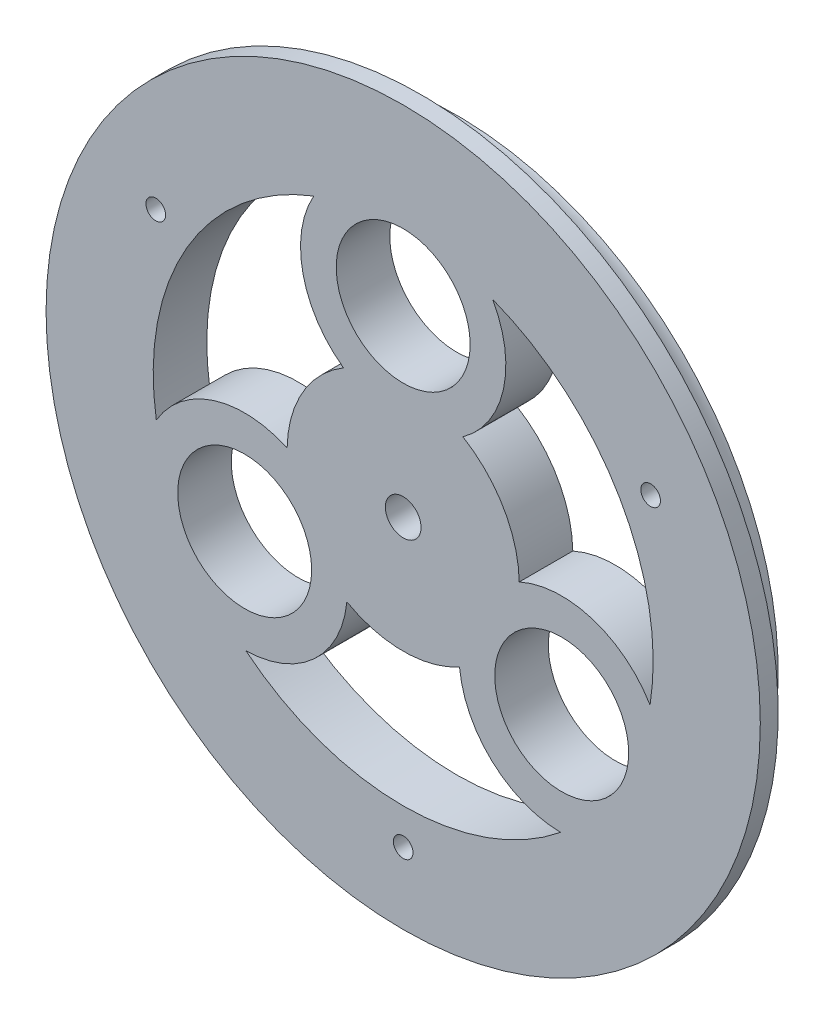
ISO-10303-21;
HEADER;
FILE_DESCRIPTION(('STEP AP214'),'2;1');
FILE_NAME('part.step','',(''),(''),'','','');
FILE_SCHEMA(('AUTOMOTIVE_DESIGN { 1 0 10303 214 1 1 1 1 }'));
ENDSEC;
DATA;
#1=APPLICATION_CONTEXT('core data for automotive mechanical design processes');
#2=APPLICATION_PROTOCOL_DEFINITION('international standard','automotive_design',2000,#1);
#3=PRODUCT_CONTEXT('',#1,'mechanical');
#4=PRODUCT('Part','Part','',(#3));
#5=PRODUCT_RELATED_PRODUCT_CATEGORY('part','',(#4));
#6=PRODUCT_DEFINITION_FORMATION('','',#4);
#7=PRODUCT_DEFINITION_CONTEXT('part definition',#1,'design');
#8=PRODUCT_DEFINITION('design','',#6,#7);
#9=PRODUCT_DEFINITION_SHAPE('','',#8);
#10=(LENGTH_UNIT() NAMED_UNIT(*) SI_UNIT(.MILLI.,.METRE.));
#11=(NAMED_UNIT(*) PLANE_ANGLE_UNIT() SI_UNIT($,.RADIAN.));
#12=(NAMED_UNIT(*) SI_UNIT($,.STERADIAN.) SOLID_ANGLE_UNIT());
#13=UNCERTAINTY_MEASURE_WITH_UNIT(LENGTH_MEASURE(1.E-05),#10,'distance_accuracy_value','');
#14=(GEOMETRIC_REPRESENTATION_CONTEXT(3) GLOBAL_UNCERTAINTY_ASSIGNED_CONTEXT((#13)) GLOBAL_UNIT_ASSIGNED_CONTEXT((#10,
#11,#12)) REPRESENTATION_CONTEXT('',''));
#15=CARTESIAN_POINT('',(0.,0.,0.));
#16=DIRECTION('',(0.,0.,1.));
#17=DIRECTION('',(1.,0.,0.));
#18=AXIS2_PLACEMENT_3D('',#15,#16,#17);
#19=CARTESIAN_POINT('',(0.,0.,0.));
#20=DIRECTION('',(0.,0.,1.));
#21=DIRECTION('',(1.,0.,0.));
#22=AXIS2_PLACEMENT_3D('',#19,#20,#21);
#23=PLANE('',#22);
#24=CARTESIAN_POINT('',(0.,0.,0.));
#25=DIRECTION('',(0.,0.,1.));
#26=DIRECTION('',(1.,0.,0.));
#27=AXIS2_PLACEMENT_3D('',#24,#25,#26);
#28=CIRCLE('',#27,28.0000000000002);
#29=CARTESIAN_POINT('',(-10.0184244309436,26.1463414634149,0.));
#30=VERTEX_POINT('',#29);
#31=CARTESIAN_POINT('',(-27.6526081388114,-4.39696066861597,0.));
#32=VERTEX_POINT('',#31);
#33=EDGE_CURVE('E54',#30,#32,#28,.T.);
#34=ORIENTED_EDGE('',*,*,#33,.T.);
#35=CARTESIAN_POINT('',(-17.7535207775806,-10.2500000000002,0.));
#36=DIRECTION('',(0.,0.,-1.));
#37=DIRECTION('',(1.,0.,0.));
#38=AXIS2_PLACEMENT_3D('',#35,#36,#37);
#39=CIRCLE('',#38,11.5000000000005);
#40=CARTESIAN_POINT('',(-12.998125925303,0.220731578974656,0.));
#41=VERTEX_POINT('',#40);
#42=EDGE_CURVE('E122',#32,#41,#39,.T.);
#43=ORIENTED_EDGE('',*,*,#42,.T.);
#44=CARTESIAN_POINT('',(0.,0.,0.));
#45=DIRECTION('',(0.,0.,-1.));
#46=DIRECTION('',(1.,0.,0.));
#47=AXIS2_PLACEMENT_3D('',#44,#45,#46);
#48=CIRCLE('',#47,12.9999999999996);
#49=CARTESIAN_POINT('',(-6.69022211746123,11.146341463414,0.));
#50=VERTEX_POINT('',#49);
#51=EDGE_CURVE('E131',#41,#50,#48,.T.);
#52=ORIENTED_EDGE('',*,*,#51,.T.);
#53=CARTESIAN_POINT('',(0.,20.5,0.));
#54=DIRECTION('',(0.,0.,-1.));
#55=DIRECTION('',(1.,0.,0.));
#56=AXIS2_PLACEMENT_3D('',#53,#54,#55);
#57=CIRCLE('',#56,11.5000000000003);
#58=EDGE_CURVE('E140',#50,#30,#57,.T.);
#59=ORIENTED_EDGE('',*,*,#58,.T.);
#60=EDGE_LOOP('',(#34,#43,#52,#59));
#61=FACE_BOUND('',#60,.T.);
#62=CARTESIAN_POINT('',(1.77712048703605E-13,-32.0000000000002,0.));
#63=DIRECTION('',(0.,0.,1.));
#64=DIRECTION('',(1.,0.,0.));
#65=AXIS2_PLACEMENT_3D('',#62,#63,#64);
#66=CIRCLE('',#65,1.1);
#67=CARTESIAN_POINT('',(1.10000000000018,-32.0000000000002,0.));
#68=VERTEX_POINT('',#67);
#69=EDGE_CURVE('E164',#68,#68,#66,.T.);
#70=ORIENTED_EDGE('',*,*,#69,.T.);
#71=EDGE_LOOP('',(#70));
#72=FACE_BOUND('',#71,.T.);
#73=CARTESIAN_POINT('',(27.7128129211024,16.0000000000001,0.));
#74=DIRECTION('',(0.,0.,1.));
#75=DIRECTION('',(1.,0.,0.));
#76=AXIS2_PLACEMENT_3D('',#73,#74,#75);
#77=CIRCLE('',#76,1.1);
#78=CARTESIAN_POINT('',(28.8128129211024,16.0000000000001,0.));
#79=VERTEX_POINT('',#78);
#80=EDGE_CURVE('E176',#79,#79,#77,.T.);
#81=ORIENTED_EDGE('',*,*,#80,.T.);
#82=EDGE_LOOP('',(#81));
#83=FACE_BOUND('',#82,.T.);
#84=CARTESIAN_POINT('',(0.,20.5,0.));
#85=DIRECTION('',(0.,0.,-1.));
#86=DIRECTION('',(1.,0.,0.));
#87=AXIS2_PLACEMENT_3D('',#84,#85,#86);
#88=CIRCLE('',#87,11.5000000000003);
#89=CARTESIAN_POINT('',(10.0184244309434,26.1463414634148,0.));
#90=VERTEX_POINT('',#89);
#91=CARTESIAN_POINT('',(6.69022211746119,11.1463414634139,0.));
#92=VERTEX_POINT('',#91);
#93=EDGE_CURVE('E213',#90,#92,#88,.T.);
#94=ORIENTED_EDGE('',*,*,#93,.T.);
#95=CARTESIAN_POINT('',(0.,0.,0.));
#96=DIRECTION('',(0.,0.,-1.));
#97=DIRECTION('',(1.,0.,0.));
#98=AXIS2_PLACEMENT_3D('',#95,#96,#97);
#99=CIRCLE('',#98,12.9999999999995);
#100=CARTESIAN_POINT('',(12.9981259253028,0.220731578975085,0.));
#101=VERTEX_POINT('',#100);
#102=EDGE_CURVE('E216',#92,#101,#99,.T.);
#103=ORIENTED_EDGE('',*,*,#102,.T.);
#104=CARTESIAN_POINT('',(17.7535207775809,-10.2500000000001,0.));
#105=DIRECTION('',(0.,0.,-1.));
#106=DIRECTION('',(1.,0.,0.));
#107=AXIS2_PLACEMENT_3D('',#104,#105,#106);
#108=CIRCLE('',#107,11.5000000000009);
#109=CARTESIAN_POINT('',(27.6526081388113,-4.39696066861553,0.));
#110=VERTEX_POINT('',#109);
#111=EDGE_CURVE('E219',#101,#110,#108,.T.);
#112=ORIENTED_EDGE('',*,*,#111,.T.);
#113=CARTESIAN_POINT('',(0.,0.,0.));
#114=DIRECTION('',(0.,0.,1.));
#115=DIRECTION('',(1.,0.,0.));
#116=AXIS2_PLACEMENT_3D('',#113,#114,#115);
#117=CIRCLE('',#116,28.0000000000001);
#118=EDGE_CURVE('E222',#110,#90,#117,.T.);
#119=ORIENTED_EDGE('',*,*,#118,.T.);
#120=EDGE_LOOP('',(#94,#103,#112,#119));
#121=FACE_BOUND('',#120,.T.);
#122=CARTESIAN_POINT('',(0.,20.5,0.));
#123=DIRECTION('',(0.,0.,1.));
#124=DIRECTION('',(1.,0.,0.));
#125=AXIS2_PLACEMENT_3D('',#122,#123,#124);
#126=CIRCLE('',#125,7.5);
#127=CARTESIAN_POINT('',(7.5,20.5,0.));
#128=VERTEX_POINT('',#127);
#129=EDGE_CURVE('E250',#128,#128,#126,.T.);
#130=ORIENTED_EDGE('',*,*,#129,.T.);
#131=EDGE_LOOP('',(#130));
#132=FACE_BOUND('',#131,.T.);
#133=CARTESIAN_POINT('',(0.,0.,0.));
#134=DIRECTION('',(0.,0.,1.));
#135=DIRECTION('',(1.,0.,0.));
#136=AXIS2_PLACEMENT_3D('',#133,#134,#135);
#137=CIRCLE('',#136,2.);
#138=CARTESIAN_POINT('',(2.,0.,0.));
#139=VERTEX_POINT('',#138);
#140=EDGE_CURVE('E256',#139,#139,#137,.T.);
#141=ORIENTED_EDGE('',*,*,#140,.T.);
#142=EDGE_LOOP('',(#141));
#143=FACE_BOUND('',#142,.T.);
#144=CARTESIAN_POINT('',(-27.712812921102,16.0000000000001,0.));
#145=DIRECTION('',(0.,0.,1.));
#146=DIRECTION('',(1.,0.,0.));
#147=AXIS2_PLACEMENT_3D('',#144,#145,#146);
#148=CIRCLE('',#147,1.1);
#149=CARTESIAN_POINT('',(-26.612812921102,16.0000000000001,0.));
#150=VERTEX_POINT('',#149);
#151=EDGE_CURVE('E244',#150,#150,#148,.T.);
#152=ORIENTED_EDGE('',*,*,#151,.T.);
#153=EDGE_LOOP('',(#152));
#154=FACE_BOUND('',#153,.T.);
#155=CARTESIAN_POINT('',(0.,0.,0.));
#156=DIRECTION('',(0.,0.,1.));
#157=DIRECTION('',(1.,0.,0.));
#158=AXIS2_PLACEMENT_3D('',#155,#156,#157);
#159=CIRCLE('',#158,28.);
#160=CARTESIAN_POINT('',(-17.6341837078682,-21.7493807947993,0.));
#161=VERTEX_POINT('',#160);
#162=CARTESIAN_POINT('',(17.6341837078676,-21.7493807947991,0.));
#163=VERTEX_POINT('',#162);
#164=EDGE_CURVE('E182',#161,#163,#159,.T.);
#165=ORIENTED_EDGE('',*,*,#164,.T.);
#166=CARTESIAN_POINT('',(17.7535207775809,-10.2500000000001,0.));
#167=DIRECTION('',(0.,0.,-1.));
#168=DIRECTION('',(1.,0.,0.));
#169=AXIS2_PLACEMENT_3D('',#166,#167,#168);
#170=CIRCLE('',#169,11.5);
#171=CARTESIAN_POINT('',(6.30790380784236,-11.367073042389,0.));
#172=VERTEX_POINT('',#171);
#173=EDGE_CURVE('E185',#163,#172,#170,.T.);
#174=ORIENTED_EDGE('',*,*,#173,.T.);
#175=CARTESIAN_POINT('',(0.,0.,0.));
#176=DIRECTION('',(0.,0.,-1.));
#177=DIRECTION('',(1.,0.,0.));
#178=AXIS2_PLACEMENT_3D('',#175,#176,#177);
#179=CIRCLE('',#178,13.);
#180=CARTESIAN_POINT('',(-6.30790380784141,-11.3670730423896,0.));
#181=VERTEX_POINT('',#180);
#182=EDGE_CURVE('E188',#172,#181,#179,.T.);
#183=ORIENTED_EDGE('',*,*,#182,.T.);
#184=CARTESIAN_POINT('',(-17.7535207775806,-10.2500000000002,0.));
#185=DIRECTION('',(0.,0.,-1.));
#186=DIRECTION('',(1.,0.,0.));
#187=AXIS2_PLACEMENT_3D('',#184,#185,#186);
#188=CIRCLE('',#187,11.5);
#189=EDGE_CURVE('E191',#181,#161,#188,.T.);
#190=ORIENTED_EDGE('',*,*,#189,.T.);
#191=EDGE_LOOP('',(#165,#174,#183,#190));
#192=FACE_BOUND('',#191,.T.);
#193=CARTESIAN_POINT('',(17.7535207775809,-10.2500000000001,0.));
#194=DIRECTION('',(0.,0.,1.));
#195=DIRECTION('',(1.,0.,0.));
#196=AXIS2_PLACEMENT_3D('',#193,#194,#195);
#197=CIRCLE('',#196,7.5);
#198=CARTESIAN_POINT('',(25.253520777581,-10.2500000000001,0.));
#199=VERTEX_POINT('',#198);
#200=EDGE_CURVE('E170',#199,#199,#197,.T.);
#201=ORIENTED_EDGE('',*,*,#200,.T.);
#202=EDGE_LOOP('',(#201));
#203=FACE_BOUND('',#202,.T.);
#204=CARTESIAN_POINT('',(-17.7535207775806,-10.2500000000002,0.));
#205=DIRECTION('',(0.,0.,1.));
#206=DIRECTION('',(1.,0.,0.));
#207=AXIS2_PLACEMENT_3D('',#204,#205,#206);
#208=CIRCLE('',#207,7.50000000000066);
#209=CARTESIAN_POINT('',(-10.2535207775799,-10.2500000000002,0.));
#210=VERTEX_POINT('',#209);
#211=EDGE_CURVE('E136',#210,#210,#208,.T.);
#212=ORIENTED_EDGE('',*,*,#211,.T.);
#213=EDGE_LOOP('',(#212));
#214=FACE_BOUND('',#213,.T.);
#215=CARTESIAN_POINT('',(0.,0.,0.));
#216=DIRECTION('',(0.,0.,-1.));
#217=DIRECTION('',(-1.,0.,0.));
#218=AXIS2_PLACEMENT_3D('',#215,#216,#217);
#219=CIRCLE('',#218,36.);
#220=CARTESIAN_POINT('',(-36.,0.,0.));
#221=VERTEX_POINT('',#220);
#222=EDGE_CURVE('E143',#221,#221,#219,.T.);
#223=ORIENTED_EDGE('',*,*,#222,.T.);
#224=EDGE_LOOP('',(#223));
#225=FACE_BOUND('',#224,.T.);
#226=ADVANCED_FACE('F30',(#61,#72,#83,#121,#132,#143,#154,#192,#203,#214,#225),#23,.F.);
#227=CARTESIAN_POINT('',(0.,0.,6.));
#228=DIRECTION('',(0.,0.,-1.));
#229=DIRECTION('',(-1.,0.,0.));
#230=AXIS2_PLACEMENT_3D('',#227,#228,#229);
#231=CYLINDRICAL_SURFACE('',#230,40.);
#232=CARTESIAN_POINT('',(0.,0.,6.));
#233=DIRECTION('',(0.,0.,1.));
#234=DIRECTION('',(1.,0.,0.));
#235=AXIS2_PLACEMENT_3D('',#232,#233,#234);
#236=CIRCLE('',#235,40.);
#237=CARTESIAN_POINT('',(40.,0.,6.));
#238=VERTEX_POINT('',#237);
#239=EDGE_CURVE('E11',#238,#238,#236,.T.);
#240=ORIENTED_EDGE('',*,*,#239,.F.);
#241=EDGE_LOOP('',(#240));
#242=FACE_BOUND('',#241,.T.);
#243=CARTESIAN_POINT('',(0.,0.,4.));
#244=DIRECTION('',(0.,0.,-1.));
#245=DIRECTION('',(-1.,0.,0.));
#246=AXIS2_PLACEMENT_3D('',#243,#244,#245);
#247=CIRCLE('',#246,40.);
#248=CARTESIAN_POINT('',(-40.,0.,4.));
#249=VERTEX_POINT('',#248);
#250=EDGE_CURVE('E34',#249,#249,#247,.T.);
#251=ORIENTED_EDGE('',*,*,#250,.F.);
#252=EDGE_LOOP('',(#251));
#253=FACE_BOUND('',#252,.T.);
#254=ADVANCED_FACE('F32',(#242,#253),#231,.T.);
#255=CARTESIAN_POINT('',(0.,0.,6.));
#256=DIRECTION('',(0.,0.,1.));
#257=DIRECTION('',(1.,0.,0.));
#258=AXIS2_PLACEMENT_3D('',#255,#256,#257);
#259=PLANE('',#258);
#260=CARTESIAN_POINT('',(-17.7535207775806,-10.2500000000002,6.));
#261=DIRECTION('',(0.,0.,1.));
#262=DIRECTION('',(1.,0.,0.));
#263=AXIS2_PLACEMENT_3D('',#260,#261,#262);
#264=CIRCLE('',#263,7.50000000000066);
#265=CARTESIAN_POINT('',(-10.2535207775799,-10.2500000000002,6.));
#266=VERTEX_POINT('',#265);
#267=EDGE_CURVE('E161',#266,#266,#264,.T.);
#268=ORIENTED_EDGE('',*,*,#267,.F.);
#269=EDGE_LOOP('',(#268));
#270=FACE_BOUND('',#269,.T.);
#271=CARTESIAN_POINT('',(17.7535207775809,-10.2500000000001,6.));
#272=DIRECTION('',(0.,0.,1.));
#273=DIRECTION('',(1.,0.,0.));
#274=AXIS2_PLACEMENT_3D('',#271,#272,#273);
#275=CIRCLE('',#274,7.5);
#276=CARTESIAN_POINT('',(25.253520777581,-10.2500000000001,6.));
#277=VERTEX_POINT('',#276);
#278=EDGE_CURVE('E173',#277,#277,#275,.T.);
#279=ORIENTED_EDGE('',*,*,#278,.F.);
#280=EDGE_LOOP('',(#279));
#281=FACE_BOUND('',#280,.T.);
#282=CARTESIAN_POINT('',(17.7535207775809,-10.2500000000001,6.));
#283=DIRECTION('',(0.,0.,-1.));
#284=DIRECTION('',(1.,0.,0.));
#285=AXIS2_PLACEMENT_3D('',#282,#283,#284);
#286=CIRCLE('',#285,11.5);
#287=CARTESIAN_POINT('',(17.6341837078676,-21.7493807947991,6.));
#288=VERTEX_POINT('',#287);
#289=CARTESIAN_POINT('',(6.30790380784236,-11.367073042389,6.));
#290=VERTEX_POINT('',#289);
#291=EDGE_CURVE('E196',#288,#290,#286,.T.);
#292=ORIENTED_EDGE('',*,*,#291,.F.);
#293=CARTESIAN_POINT('',(0.,0.,6.));
#294=DIRECTION('',(0.,0.,1.));
#295=DIRECTION('',(1.,0.,0.));
#296=AXIS2_PLACEMENT_3D('',#293,#294,#295);
#297=CIRCLE('',#296,28.);
#298=CARTESIAN_POINT('',(-17.6341837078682,-21.7493807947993,6.));
#299=VERTEX_POINT('',#298);
#300=EDGE_CURVE('E194',#299,#288,#297,.T.);
#301=ORIENTED_EDGE('',*,*,#300,.F.);
#302=CARTESIAN_POINT('',(-17.7535207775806,-10.2500000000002,6.));
#303=DIRECTION('',(0.,0.,-1.));
#304=DIRECTION('',(1.,0.,0.));
#305=AXIS2_PLACEMENT_3D('',#302,#303,#304);
#306=CIRCLE('',#305,11.5);
#307=CARTESIAN_POINT('',(-6.30790380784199,-11.3670730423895,6.));
#308=VERTEX_POINT('',#307);
#309=EDGE_CURVE('E201',#308,#299,#306,.T.);
#310=ORIENTED_EDGE('',*,*,#309,.F.);
#311=CARTESIAN_POINT('',(0.,0.,6.));
#312=DIRECTION('',(0.,0.,-1.));
#313=DIRECTION('',(1.,0.,0.));
#314=AXIS2_PLACEMENT_3D('',#311,#312,#313);
#315=CIRCLE('',#314,13.);
#316=EDGE_CURVE('E198',#290,#308,#315,.T.);
#317=ORIENTED_EDGE('',*,*,#316,.F.);
#318=EDGE_LOOP('',(#292,#301,#310,#317));
#319=FACE_BOUND('',#318,.T.);
#320=CARTESIAN_POINT('',(-27.712812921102,16.0000000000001,6.));
#321=DIRECTION('',(0.,0.,1.));
#322=DIRECTION('',(1.,0.,0.));
#323=AXIS2_PLACEMENT_3D('',#320,#321,#322);
#324=CIRCLE('',#323,1.1);
#325=CARTESIAN_POINT('',(-26.612812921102,16.0000000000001,6.));
#326=VERTEX_POINT('',#325);
#327=EDGE_CURVE('E247',#326,#326,#324,.T.);
#328=ORIENTED_EDGE('',*,*,#327,.F.);
#329=EDGE_LOOP('',(#328));
#330=FACE_BOUND('',#329,.T.);
#331=CARTESIAN_POINT('',(0.,0.,6.));
#332=DIRECTION('',(0.,0.,1.));
#333=DIRECTION('',(1.,0.,0.));
#334=AXIS2_PLACEMENT_3D('',#331,#332,#333);
#335=CIRCLE('',#334,2.);
#336=CARTESIAN_POINT('',(2.,0.,6.));
#337=VERTEX_POINT('',#336);
#338=EDGE_CURVE('E39',#337,#337,#335,.T.);
#339=ORIENTED_EDGE('',*,*,#338,.F.);
#340=EDGE_LOOP('',(#339));
#341=FACE_BOUND('',#340,.T.);
#342=ORIENTED_EDGE('',*,*,#239,.T.);
#343=EDGE_LOOP('',(#342));
#344=FACE_BOUND('',#343,.T.);
#345=CARTESIAN_POINT('',(0.,20.5,6.));
#346=DIRECTION('',(0.,0.,1.));
#347=DIRECTION('',(1.,0.,0.));
#348=AXIS2_PLACEMENT_3D('',#345,#346,#347);
#349=CIRCLE('',#348,7.5);
#350=CARTESIAN_POINT('',(7.5,20.5,6.));
#351=VERTEX_POINT('',#350);
#352=EDGE_CURVE('E253',#351,#351,#349,.T.);
#353=ORIENTED_EDGE('',*,*,#352,.F.);
#354=EDGE_LOOP('',(#353));
#355=FACE_BOUND('',#354,.T.);
#356=CARTESIAN_POINT('',(0.,0.,6.));
#357=DIRECTION('',(0.,0.,-1.));
#358=DIRECTION('',(1.,0.,0.));
#359=AXIS2_PLACEMENT_3D('',#356,#357,#358);
#360=CIRCLE('',#359,12.9999999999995);
#361=CARTESIAN_POINT('',(6.69022211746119,11.1463414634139,6.));
#362=VERTEX_POINT('',#361);
#363=CARTESIAN_POINT('',(12.9981259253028,0.220731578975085,6.));
#364=VERTEX_POINT('',#363);
#365=EDGE_CURVE('E227',#362,#364,#360,.T.);
#366=ORIENTED_EDGE('',*,*,#365,.F.);
#367=CARTESIAN_POINT('',(0.,20.5,6.));
#368=DIRECTION('',(0.,0.,-1.));
#369=DIRECTION('',(1.,0.,0.));
#370=AXIS2_PLACEMENT_3D('',#367,#368,#369);
#371=CIRCLE('',#370,11.5000000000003);
#372=CARTESIAN_POINT('',(10.0184244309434,26.1463414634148,6.));
#373=VERTEX_POINT('',#372);
#374=EDGE_CURVE('E225',#373,#362,#371,.T.);
#375=ORIENTED_EDGE('',*,*,#374,.F.);
#376=CARTESIAN_POINT('',(0.,0.,6.));
#377=DIRECTION('',(0.,0.,1.));
#378=DIRECTION('',(1.,0.,0.));
#379=AXIS2_PLACEMENT_3D('',#376,#377,#378);
#380=CIRCLE('',#379,28.0000000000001);
#381=CARTESIAN_POINT('',(27.6526081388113,-4.39696066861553,6.));
#382=VERTEX_POINT('',#381);
#383=EDGE_CURVE('E232',#382,#373,#380,.T.);
#384=ORIENTED_EDGE('',*,*,#383,.F.);
#385=CARTESIAN_POINT('',(17.7535207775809,-10.2500000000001,6.));
#386=DIRECTION('',(0.,0.,-1.));
#387=DIRECTION('',(1.,0.,0.));
#388=AXIS2_PLACEMENT_3D('',#385,#386,#387);
#389=CIRCLE('',#388,11.5000000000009);
#390=EDGE_CURVE('E229',#364,#382,#389,.T.);
#391=ORIENTED_EDGE('',*,*,#390,.F.);
#392=EDGE_LOOP('',(#366,#375,#384,#391));
#393=FACE_BOUND('',#392,.T.);
#394=CARTESIAN_POINT('',(27.7128129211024,16.0000000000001,6.));
#395=DIRECTION('',(0.,0.,1.));
#396=DIRECTION('',(1.,0.,0.));
#397=AXIS2_PLACEMENT_3D('',#394,#395,#396);
#398=CIRCLE('',#397,1.1);
#399=CARTESIAN_POINT('',(28.8128129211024,16.0000000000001,6.));
#400=VERTEX_POINT('',#399);
#401=EDGE_CURVE('E179',#400,#400,#398,.T.);
#402=ORIENTED_EDGE('',*,*,#401,.F.);
#403=EDGE_LOOP('',(#402));
#404=FACE_BOUND('',#403,.T.);
#405=CARTESIAN_POINT('',(1.77712048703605E-13,-32.0000000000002,6.));
#406=DIRECTION('',(0.,0.,1.));
#407=DIRECTION('',(1.,0.,0.));
#408=AXIS2_PLACEMENT_3D('',#405,#406,#407);
#409=CIRCLE('',#408,1.1);
#410=CARTESIAN_POINT('',(1.10000000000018,-32.0000000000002,6.));
#411=VERTEX_POINT('',#410);
#412=EDGE_CURVE('E167',#411,#411,#409,.T.);
#413=ORIENTED_EDGE('',*,*,#412,.F.);
#414=EDGE_LOOP('',(#413));
#415=FACE_BOUND('',#414,.T.);
#416=CARTESIAN_POINT('',(-17.7535207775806,-10.2500000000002,6.));
#417=DIRECTION('',(0.,0.,-1.));
#418=DIRECTION('',(1.,0.,0.));
#419=AXIS2_PLACEMENT_3D('',#416,#417,#418);
#420=CIRCLE('',#419,11.5000000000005);
#421=CARTESIAN_POINT('',(-27.6526081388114,-4.39696066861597,6.));
#422=VERTEX_POINT('',#421);
#423=CARTESIAN_POINT('',(-12.998125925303,0.220731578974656,6.));
#424=VERTEX_POINT('',#423);
#425=EDGE_CURVE('E149',#422,#424,#420,.T.);
#426=ORIENTED_EDGE('',*,*,#425,.F.);
#427=CARTESIAN_POINT('',(0.,0.,6.));
#428=DIRECTION('',(0.,0.,1.));
#429=DIRECTION('',(1.,0.,0.));
#430=AXIS2_PLACEMENT_3D('',#427,#428,#429);
#431=CIRCLE('',#430,28.0000000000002);
#432=CARTESIAN_POINT('',(-10.0184244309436,26.1463414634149,6.));
#433=VERTEX_POINT('',#432);
#434=EDGE_CURVE('E135',#433,#422,#431,.T.);
#435=ORIENTED_EDGE('',*,*,#434,.F.);
#436=CARTESIAN_POINT('',(0.,20.5,6.));
#437=DIRECTION('',(0.,0.,-1.));
#438=DIRECTION('',(1.,0.,0.));
#439=AXIS2_PLACEMENT_3D('',#436,#437,#438);
#440=CIRCLE('',#439,11.5000000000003);
#441=CARTESIAN_POINT('',(-6.69022211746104,11.1463414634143,6.));
#442=VERTEX_POINT('',#441);
#443=EDGE_CURVE('E153',#442,#433,#440,.T.);
#444=ORIENTED_EDGE('',*,*,#443,.F.);
#445=CARTESIAN_POINT('',(0.,0.,6.));
#446=DIRECTION('',(0.,0.,-1.));
#447=DIRECTION('',(1.,0.,0.));
#448=AXIS2_PLACEMENT_3D('',#445,#446,#447);
#449=CIRCLE('',#448,12.9999999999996);
#450=EDGE_CURVE('E151',#424,#442,#449,.T.);
#451=ORIENTED_EDGE('',*,*,#450,.F.);
#452=EDGE_LOOP('',(#426,#435,#444,#451));
#453=FACE_BOUND('',#452,.T.);
#454=ADVANCED_FACE('F265',(#270,#281,#319,#330,#341,#344,#355,#393,#404,#415,#453),#259,.T.);
#455=CARTESIAN_POINT('',(0.,0.,6.));
#456=DIRECTION('',(0.,0.,-1.));
#457=DIRECTION('',(-1.,0.,0.));
#458=AXIS2_PLACEMENT_3D('',#455,#456,#457);
#459=CYLINDRICAL_SURFACE('',#458,2.);
#460=ORIENTED_EDGE('',*,*,#338,.T.);
#461=EDGE_LOOP('',(#460));
#462=FACE_BOUND('',#461,.T.);
#463=ORIENTED_EDGE('',*,*,#140,.F.);
#464=EDGE_LOOP('',(#463));
#465=FACE_BOUND('',#464,.T.);
#466=ADVANCED_FACE('F262',(#462,#465),#459,.F.);
#467=CARTESIAN_POINT('',(0.,20.5,6.));
#468=DIRECTION('',(0.,0.,-1.));
#469=DIRECTION('',(-1.,0.,0.));
#470=AXIS2_PLACEMENT_3D('',#467,#468,#469);
#471=CYLINDRICAL_SURFACE('',#470,7.5);
#472=ORIENTED_EDGE('',*,*,#352,.T.);
#473=EDGE_LOOP('',(#472));
#474=FACE_BOUND('',#473,.T.);
#475=ORIENTED_EDGE('',*,*,#129,.F.);
#476=EDGE_LOOP('',(#475));
#477=FACE_BOUND('',#476,.T.);
#478=ADVANCED_FACE('F305',(#474,#477),#471,.F.);
#479=CARTESIAN_POINT('',(-27.712812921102,16.0000000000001,6.));
#480=DIRECTION('',(0.,0.,-1.));
#481=DIRECTION('',(-1.,0.,0.));
#482=AXIS2_PLACEMENT_3D('',#479,#480,#481);
#483=CYLINDRICAL_SURFACE('',#482,1.1);
#484=ORIENTED_EDGE('',*,*,#327,.T.);
#485=EDGE_LOOP('',(#484));
#486=FACE_BOUND('',#485,.T.);
#487=ORIENTED_EDGE('',*,*,#151,.F.);
#488=EDGE_LOOP('',(#487));
#489=FACE_BOUND('',#488,.T.);
#490=ADVANCED_FACE('F308',(#486,#489),#483,.F.);
#491=CARTESIAN_POINT('',(0.,20.5,6.));
#492=DIRECTION('',(0.,0.,-1.));
#493=DIRECTION('',(-1.,0.,0.));
#494=AXIS2_PLACEMENT_3D('',#491,#492,#493);
#495=CYLINDRICAL_SURFACE('',#494,11.5000000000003);
#496=ORIENTED_EDGE('',*,*,#93,.F.);
#497=DIRECTION('',(0.,0.,-1.));
#498=VECTOR('',#497,1.);
#499=CARTESIAN_POINT('',(10.0184244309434,26.1463414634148,6.));
#500=LINE('',#499,#498);
#501=EDGE_CURVE('E234',#373,#90,#500,.T.);
#502=ORIENTED_EDGE('',*,*,#501,.F.);
#503=ORIENTED_EDGE('',*,*,#374,.T.);
#504=DIRECTION('',(0.,0.,-1.));
#505=VECTOR('',#504,1.);
#506=CARTESIAN_POINT('',(6.69022211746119,11.1463414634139,6.));
#507=LINE('',#506,#505);
#508=EDGE_CURVE('E241',#362,#92,#507,.T.);
#509=ORIENTED_EDGE('',*,*,#508,.T.);
#510=EDGE_LOOP('',(#496,#502,#503,#509));
#511=FACE_BOUND('',#510,.T.);
#512=ADVANCED_FACE('F312',(#511),#495,.T.);
#513=CARTESIAN_POINT('',(0.,0.,6.));
#514=DIRECTION('',(0.,0.,-1.));
#515=DIRECTION('',(-1.,0.,0.));
#516=AXIS2_PLACEMENT_3D('',#513,#514,#515);
#517=CYLINDRICAL_SURFACE('',#516,12.9999999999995);
#518=ORIENTED_EDGE('',*,*,#102,.F.);
#519=ORIENTED_EDGE('',*,*,#508,.F.);
#520=ORIENTED_EDGE('',*,*,#365,.T.);
#521=DIRECTION('',(0.,0.,-1.));
#522=VECTOR('',#521,1.);
#523=CARTESIAN_POINT('',(12.9981259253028,0.220731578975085,6.));
#524=LINE('',#523,#522);
#525=EDGE_CURVE('E239',#364,#101,#524,.T.);
#526=ORIENTED_EDGE('',*,*,#525,.T.);
#527=EDGE_LOOP('',(#518,#519,#520,#526));
#528=FACE_BOUND('',#527,.T.);
#529=ADVANCED_FACE('F316',(#528),#517,.T.);
#530=CARTESIAN_POINT('',(17.7535207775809,-10.2500000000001,6.));
#531=DIRECTION('',(0.,0.,-1.));
#532=DIRECTION('',(-1.,0.,0.));
#533=AXIS2_PLACEMENT_3D('',#530,#531,#532);
#534=CYLINDRICAL_SURFACE('',#533,11.5000000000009);
#535=ORIENTED_EDGE('',*,*,#111,.F.);
#536=ORIENTED_EDGE('',*,*,#525,.F.);
#537=ORIENTED_EDGE('',*,*,#390,.T.);
#538=DIRECTION('',(0.,0.,-1.));
#539=VECTOR('',#538,1.);
#540=CARTESIAN_POINT('',(27.6526081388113,-4.39696066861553,6.));
#541=LINE('',#540,#539);
#542=EDGE_CURVE('E237',#382,#110,#541,.T.);
#543=ORIENTED_EDGE('',*,*,#542,.T.);
#544=EDGE_LOOP('',(#535,#536,#537,#543));
#545=FACE_BOUND('',#544,.T.);
#546=ADVANCED_FACE('F320',(#545),#534,.T.);
#547=CARTESIAN_POINT('',(0.,0.,6.));
#548=DIRECTION('',(0.,0.,-1.));
#549=DIRECTION('',(-1.,0.,0.));
#550=AXIS2_PLACEMENT_3D('',#547,#548,#549);
#551=CYLINDRICAL_SURFACE('',#550,28.0000000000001);
#552=ORIENTED_EDGE('',*,*,#118,.F.);
#553=ORIENTED_EDGE('',*,*,#542,.F.);
#554=ORIENTED_EDGE('',*,*,#383,.T.);
#555=ORIENTED_EDGE('',*,*,#501,.T.);
#556=EDGE_LOOP('',(#552,#553,#554,#555));
#557=FACE_BOUND('',#556,.T.);
#558=ADVANCED_FACE('F324',(#557),#551,.F.);
#559=CARTESIAN_POINT('',(0.,0.,6.));
#560=DIRECTION('',(0.,0.,-1.));
#561=DIRECTION('',(-1.,0.,0.));
#562=AXIS2_PLACEMENT_3D('',#559,#560,#561);
#563=CYLINDRICAL_SURFACE('',#562,28.);
#564=ORIENTED_EDGE('',*,*,#164,.F.);
#565=DIRECTION('',(0.,0.,-1.));
#566=VECTOR('',#565,1.);
#567=CARTESIAN_POINT('',(-17.6341837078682,-21.7493807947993,6.));
#568=LINE('',#567,#566);
#569=EDGE_CURVE('E203',#299,#161,#568,.T.);
#570=ORIENTED_EDGE('',*,*,#569,.F.);
#571=ORIENTED_EDGE('',*,*,#300,.T.);
#572=DIRECTION('',(0.,0.,-1.));
#573=VECTOR('',#572,1.);
#574=CARTESIAN_POINT('',(17.6341837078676,-21.7493807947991,6.));
#575=LINE('',#574,#573);
#576=EDGE_CURVE('E210',#288,#163,#575,.T.);
#577=ORIENTED_EDGE('',*,*,#576,.T.);
#578=EDGE_LOOP('',(#564,#570,#571,#577));
#579=FACE_BOUND('',#578,.T.);
#580=ADVANCED_FACE('F328',(#579),#563,.F.);
#581=CARTESIAN_POINT('',(17.7535207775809,-10.2500000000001,6.));
#582=DIRECTION('',(0.,0.,-1.));
#583=DIRECTION('',(-1.,0.,0.));
#584=AXIS2_PLACEMENT_3D('',#581,#582,#583);
#585=CYLINDRICAL_SURFACE('',#584,11.5);
#586=ORIENTED_EDGE('',*,*,#173,.F.);
#587=ORIENTED_EDGE('',*,*,#576,.F.);
#588=ORIENTED_EDGE('',*,*,#291,.T.);
#589=DIRECTION('',(0.,0.,-1.));
#590=VECTOR('',#589,1.);
#591=CARTESIAN_POINT('',(6.30790380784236,-11.367073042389,6.));
#592=LINE('',#591,#590);
#593=EDGE_CURVE('E208',#290,#172,#592,.T.);
#594=ORIENTED_EDGE('',*,*,#593,.T.);
#595=EDGE_LOOP('',(#586,#587,#588,#594));
#596=FACE_BOUND('',#595,.T.);
#597=ADVANCED_FACE('F332',(#596),#585,.T.);
#598=CARTESIAN_POINT('',(0.,0.,6.));
#599=DIRECTION('',(0.,0.,-1.));
#600=DIRECTION('',(-1.,0.,0.));
#601=AXIS2_PLACEMENT_3D('',#598,#599,#600);
#602=CYLINDRICAL_SURFACE('',#601,13.);
#603=ORIENTED_EDGE('',*,*,#182,.F.);
#604=ORIENTED_EDGE('',*,*,#593,.F.);
#605=ORIENTED_EDGE('',*,*,#316,.T.);
#606=DIRECTION('',(0.,0.,-1.));
#607=VECTOR('',#606,1.);
#608=CARTESIAN_POINT('',(-6.30790380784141,-11.3670730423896,6.));
#609=LINE('',#608,#607);
#610=EDGE_CURVE('E206',#308,#181,#609,.T.);
#611=ORIENTED_EDGE('',*,*,#610,.T.);
#612=EDGE_LOOP('',(#603,#604,#605,#611));
#613=FACE_BOUND('',#612,.T.);
#614=ADVANCED_FACE('F336',(#613),#602,.T.);
#615=CARTESIAN_POINT('',(-17.7535207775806,-10.2500000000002,6.));
#616=DIRECTION('',(0.,0.,-1.));
#617=DIRECTION('',(-1.,0.,0.));
#618=AXIS2_PLACEMENT_3D('',#615,#616,#617);
#619=CYLINDRICAL_SURFACE('',#618,11.5);
#620=ORIENTED_EDGE('',*,*,#189,.F.);
#621=ORIENTED_EDGE('',*,*,#610,.F.);
#622=ORIENTED_EDGE('',*,*,#309,.T.);
#623=ORIENTED_EDGE('',*,*,#569,.T.);
#624=EDGE_LOOP('',(#620,#621,#622,#623));
#625=FACE_BOUND('',#624,.T.);
#626=ADVANCED_FACE('F340',(#625),#619,.T.);
#627=CARTESIAN_POINT('',(27.7128129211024,16.0000000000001,6.));
#628=DIRECTION('',(0.,0.,-1.));
#629=DIRECTION('',(-1.,0.,0.));
#630=AXIS2_PLACEMENT_3D('',#627,#628,#629);
#631=CYLINDRICAL_SURFACE('',#630,1.1);
#632=ORIENTED_EDGE('',*,*,#401,.T.);
#633=EDGE_LOOP('',(#632));
#634=FACE_BOUND('',#633,.T.);
#635=ORIENTED_EDGE('',*,*,#80,.F.);
#636=EDGE_LOOP('',(#635));
#637=FACE_BOUND('',#636,.T.);
#638=ADVANCED_FACE('F344',(#634,#637),#631,.F.);
#639=CARTESIAN_POINT('',(17.7535207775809,-10.2500000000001,6.));
#640=DIRECTION('',(0.,0.,-1.));
#641=DIRECTION('',(-1.,0.,0.));
#642=AXIS2_PLACEMENT_3D('',#639,#640,#641);
#643=CYLINDRICAL_SURFACE('',#642,7.5);
#644=ORIENTED_EDGE('',*,*,#278,.T.);
#645=EDGE_LOOP('',(#644));
#646=FACE_BOUND('',#645,.T.);
#647=ORIENTED_EDGE('',*,*,#200,.F.);
#648=EDGE_LOOP('',(#647));
#649=FACE_BOUND('',#648,.T.);
#650=ADVANCED_FACE('F348',(#646,#649),#643,.F.);
#651=CARTESIAN_POINT('',(1.77712048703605E-13,-32.0000000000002,6.));
#652=DIRECTION('',(0.,0.,-1.));
#653=DIRECTION('',(-1.,0.,0.));
#654=AXIS2_PLACEMENT_3D('',#651,#652,#653);
#655=CYLINDRICAL_SURFACE('',#654,1.1);
#656=ORIENTED_EDGE('',*,*,#412,.T.);
#657=EDGE_LOOP('',(#656));
#658=FACE_BOUND('',#657,.T.);
#659=ORIENTED_EDGE('',*,*,#69,.F.);
#660=EDGE_LOOP('',(#659));
#661=FACE_BOUND('',#660,.T.);
#662=ADVANCED_FACE('F352',(#658,#661),#655,.F.);
#663=CARTESIAN_POINT('',(-17.7535207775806,-10.2500000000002,6.));
#664=DIRECTION('',(0.,0.,-1.));
#665=DIRECTION('',(-1.,0.,0.));
#666=AXIS2_PLACEMENT_3D('',#663,#664,#665);
#667=CYLINDRICAL_SURFACE('',#666,7.50000000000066);
#668=ORIENTED_EDGE('',*,*,#267,.T.);
#669=EDGE_LOOP('',(#668));
#670=FACE_BOUND('',#669,.T.);
#671=ORIENTED_EDGE('',*,*,#211,.F.);
#672=EDGE_LOOP('',(#671));
#673=FACE_BOUND('',#672,.T.);
#674=ADVANCED_FACE('F356',(#670,#673),#667,.F.);
#675=CARTESIAN_POINT('',(0.,0.,6.));
#676=DIRECTION('',(0.,0.,-1.));
#677=DIRECTION('',(-1.,0.,0.));
#678=AXIS2_PLACEMENT_3D('',#675,#676,#677);
#679=CYLINDRICAL_SURFACE('',#678,28.0000000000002);
#680=ORIENTED_EDGE('',*,*,#33,.F.);
#681=DIRECTION('',(0.,0.,-1.));
#682=VECTOR('',#681,1.);
#683=CARTESIAN_POINT('',(-10.0184244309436,26.1463414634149,6.));
#684=LINE('',#683,#682);
#685=EDGE_CURVE('E155',#433,#30,#684,.T.);
#686=ORIENTED_EDGE('',*,*,#685,.F.);
#687=ORIENTED_EDGE('',*,*,#434,.T.);
#688=DIRECTION('',(0.,0.,-1.));
#689=VECTOR('',#688,1.);
#690=CARTESIAN_POINT('',(-27.6526081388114,-4.39696066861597,6.));
#691=LINE('',#690,#689);
#692=EDGE_CURVE('E124',#422,#32,#691,.T.);
#693=ORIENTED_EDGE('',*,*,#692,.T.);
#694=EDGE_LOOP('',(#680,#686,#687,#693));
#695=FACE_BOUND('',#694,.T.);
#696=ADVANCED_FACE('F133',(#695),#679,.F.);
#697=CARTESIAN_POINT('',(-17.7535207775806,-10.2500000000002,6.));
#698=DIRECTION('',(0.,0.,-1.));
#699=DIRECTION('',(-1.,0.,0.));
#700=AXIS2_PLACEMENT_3D('',#697,#698,#699);
#701=CYLINDRICAL_SURFACE('',#700,11.5000000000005);
#702=ORIENTED_EDGE('',*,*,#42,.F.);
#703=ORIENTED_EDGE('',*,*,#692,.F.);
#704=ORIENTED_EDGE('',*,*,#425,.T.);
#705=DIRECTION('',(0.,0.,-1.));
#706=VECTOR('',#705,1.);
#707=CARTESIAN_POINT('',(-12.998125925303,0.220731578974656,6.));
#708=LINE('',#707,#706);
#709=EDGE_CURVE('E127',#424,#41,#708,.T.);
#710=ORIENTED_EDGE('',*,*,#709,.T.);
#711=EDGE_LOOP('',(#702,#703,#704,#710));
#712=FACE_BOUND('',#711,.T.);
#713=ADVANCED_FACE('F123',(#712),#701,.T.);
#714=CARTESIAN_POINT('',(0.,0.,6.));
#715=DIRECTION('',(0.,0.,-1.));
#716=DIRECTION('',(-1.,0.,0.));
#717=AXIS2_PLACEMENT_3D('',#714,#715,#716);
#718=CYLINDRICAL_SURFACE('',#717,12.9999999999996);
#719=ORIENTED_EDGE('',*,*,#51,.F.);
#720=ORIENTED_EDGE('',*,*,#709,.F.);
#721=ORIENTED_EDGE('',*,*,#450,.T.);
#722=DIRECTION('',(0.,0.,-1.));
#723=VECTOR('',#722,1.);
#724=CARTESIAN_POINT('',(-6.69022211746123,11.146341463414,6.));
#725=LINE('',#724,#723);
#726=EDGE_CURVE('E46',#442,#50,#725,.T.);
#727=ORIENTED_EDGE('',*,*,#726,.T.);
#728=EDGE_LOOP('',(#719,#720,#721,#727));
#729=FACE_BOUND('',#728,.T.);
#730=ADVANCED_FACE('F284',(#729),#718,.T.);
#731=CARTESIAN_POINT('',(0.,20.5,6.));
#732=DIRECTION('',(0.,0.,-1.));
#733=DIRECTION('',(-1.,0.,0.));
#734=AXIS2_PLACEMENT_3D('',#731,#732,#733);
#735=CYLINDRICAL_SURFACE('',#734,11.5000000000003);
#736=ORIENTED_EDGE('',*,*,#58,.F.);
#737=ORIENTED_EDGE('',*,*,#726,.F.);
#738=ORIENTED_EDGE('',*,*,#443,.T.);
#739=ORIENTED_EDGE('',*,*,#685,.T.);
#740=EDGE_LOOP('',(#736,#737,#738,#739));
#741=FACE_BOUND('',#740,.T.);
#742=ADVANCED_FACE('F285',(#741),#735,.T.);
#743=CARTESIAN_POINT('',(0.,0.,0.));
#744=DIRECTION('',(0.,0.,-1.));
#745=DIRECTION('',(-1.,0.,0.));
#746=AXIS2_PLACEMENT_3D('',#743,#744,#745);
#747=TOROIDAL_SURFACE('',#746,40.,4.);
#748=ORIENTED_EDGE('',*,*,#250,.T.);
#749=EDGE_LOOP('',(#748));
#750=FACE_BOUND('',#749,.T.);
#751=ORIENTED_EDGE('',*,*,#222,.F.);
#752=EDGE_LOOP('',(#751));
#753=FACE_BOUND('',#752,.T.);
#754=ADVANCED_FACE('F287',(#750,#753),#747,.F.);
#755=CLOSED_SHELL('',(#226,#254,#454,#466,#478,#490,#512,#529,#546,#558,#580,#597,#614,#626,
#638,#650,#662,#674,#696,#713,#730,#742,#754));
#756=MANIFOLD_SOLID_BREP('B2',#755);
#757=ADVANCED_BREP_SHAPE_REPRESENTATION('',(#18,#756),#14);
#758=SHAPE_DEFINITION_REPRESENTATION(#9,#757);
ENDSEC;
END-ISO-10303-21;
